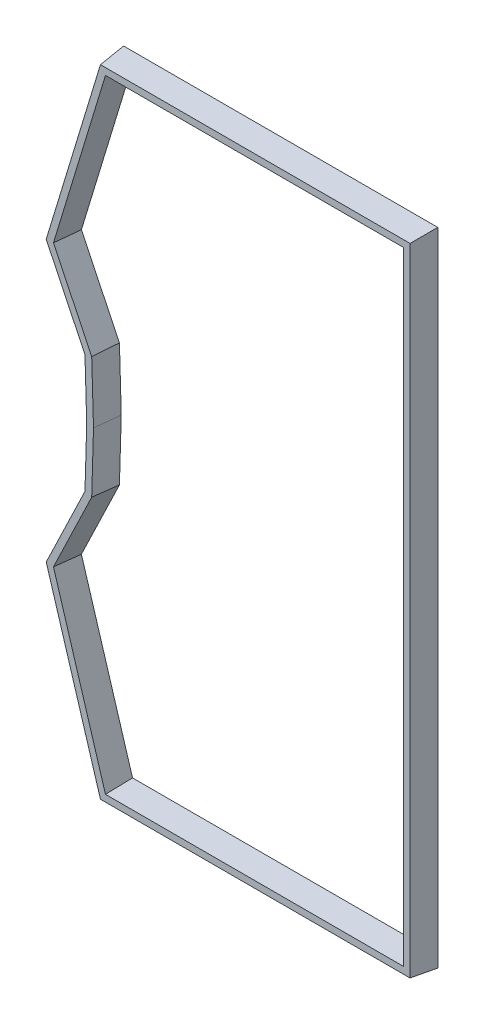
ISO-10303-21;
HEADER;
FILE_DESCRIPTION(('STEP AP214'),'2;1');
FILE_NAME('part.step','',(''),(''),'','','');
FILE_SCHEMA(('AUTOMOTIVE_DESIGN { 1 0 10303 214 1 1 1 1 }'));
ENDSEC;
DATA;
#1=APPLICATION_CONTEXT('core data for automotive mechanical design processes');
#2=APPLICATION_PROTOCOL_DEFINITION('international standard','automotive_design',2000,#1);
#3=PRODUCT_CONTEXT('',#1,'mechanical');
#4=PRODUCT('Part','Part','',(#3));
#5=PRODUCT_RELATED_PRODUCT_CATEGORY('part','',(#4));
#6=PRODUCT_DEFINITION_FORMATION('','',#4);
#7=PRODUCT_DEFINITION_CONTEXT('part definition',#1,'design');
#8=PRODUCT_DEFINITION('design','',#6,#7);
#9=PRODUCT_DEFINITION_SHAPE('','',#8);
#10=(LENGTH_UNIT() NAMED_UNIT(*) SI_UNIT(.MILLI.,.METRE.));
#11=(NAMED_UNIT(*) PLANE_ANGLE_UNIT() SI_UNIT($,.RADIAN.));
#12=(NAMED_UNIT(*) SI_UNIT($,.STERADIAN.) SOLID_ANGLE_UNIT());
#13=UNCERTAINTY_MEASURE_WITH_UNIT(LENGTH_MEASURE(1.E-05),#10,'distance_accuracy_value','');
#14=(GEOMETRIC_REPRESENTATION_CONTEXT(3) GLOBAL_UNCERTAINTY_ASSIGNED_CONTEXT((#13)) GLOBAL_UNIT_ASSIGNED_CONTEXT((#10,
#11,#12)) REPRESENTATION_CONTEXT('',''));
#15=CARTESIAN_POINT('',(0.,0.,0.));
#16=DIRECTION('',(0.,0.,1.));
#17=DIRECTION('',(1.,0.,0.));
#18=AXIS2_PLACEMENT_3D('',#15,#16,#17);
#19=CARTESIAN_POINT('',(0.,0.,2.5));
#20=DIRECTION('',(0.,0.,1.));
#21=DIRECTION('',(1.,0.,0.));
#22=AXIS2_PLACEMENT_3D('',#19,#20,#21);
#23=PLANE('',#22);
#24=DIRECTION('',(-0.433488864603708,0.901158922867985,0.));
#25=VECTOR('',#24,1.);
#26=CARTESIAN_POINT('',(9.62150357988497,48.8071060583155,2.5));
#27=LINE('',#26,#25);
#28=CARTESIAN_POINT('',(9.66591612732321,48.7147789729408,2.5));
#29=VERTEX_POINT('',#28);
#30=CARTESIAN_POINT('',(13.5234923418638,40.6954513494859,2.5));
#31=VERTEX_POINT('',#30);
#32=EDGE_CURVE('E179',#29,#31,#27,.F.);
#33=ORIENTED_EDGE('',*,*,#32,.T.);
#34=DIRECTION('',(-0.0296762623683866,0.999559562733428,0.));
#35=VECTOR('',#34,1.);
#36=CARTESIAN_POINT('',(13.5251489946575,40.6396517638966,2.5));
#37=LINE('',#36,#35);
#38=CARTESIAN_POINT('',(13.6985075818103,34.8005662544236,2.5));
#39=VERTEX_POINT('',#38);
#40=EDGE_CURVE('E199',#31,#39,#37,.F.);
#41=ORIENTED_EDGE('',*,*,#40,.T.);
#42=DIRECTION('',(0.0296762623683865,0.999559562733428,0.));
#43=VECTOR('',#42,1.);
#44=CARTESIAN_POINT('',(13.6982760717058,34.7927685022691,2.5));
#45=LINE('',#44,#43);
#46=CARTESIAN_POINT('',(13.5234923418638,28.9056811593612,2.5));
#47=VERTEX_POINT('',#46);
#48=EDGE_CURVE('E203',#39,#47,#45,.F.);
#49=ORIENTED_EDGE('',*,*,#48,.T.);
#50=DIRECTION('',(0.433488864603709,0.901158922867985,0.));
#51=VECTOR('',#50,1.);
#52=CARTESIAN_POINT('',(13.4992931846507,28.8553747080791,2.5));
#53=LINE('',#52,#51);
#54=CARTESIAN_POINT('',(9.6659161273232,20.8863535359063,2.5));
#55=VERTEX_POINT('',#54);
#56=EDGE_CURVE('E212',#47,#55,#53,.F.);
#57=ORIENTED_EDGE('',*,*,#56,.T.);
#58=DIRECTION('',(-0.290931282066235,0.9567439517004,0.));
#59=VECTOR('',#58,1.);
#60=CARTESIAN_POINT('',(9.6361091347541,20.9843755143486,2.5));
#61=LINE('',#60,#59);
#62=CARTESIAN_POINT('',(15.0644512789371,3.13296580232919,2.5));
#63=VERTEX_POINT('',#62);
#64=EDGE_CURVE('E214',#55,#63,#61,.F.);
#65=ORIENTED_EDGE('',*,*,#64,.T.);
#66=DIRECTION('',(-1.,0.,0.));
#67=VECTOR('',#66,1.);
#68=CARTESIAN_POINT('',(14.8697123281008,3.13296580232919,2.5));
#69=LINE('',#68,#67);
#70=CARTESIAN_POINT('',(45.8863174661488,3.13296580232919,2.5));
#71=VERTEX_POINT('',#70);
#72=EDGE_CURVE('E216',#63,#71,#69,.F.);
#73=ORIENTED_EDGE('',*,*,#72,.T.);
#74=DIRECTION('',(0.,-1.,0.));
#75=VECTOR('',#74,1.);
#76=CARTESIAN_POINT('',(45.8863174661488,2.870205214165,2.5));
#77=LINE('',#76,#75);
#78=CARTESIAN_POINT('',(45.8863174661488,66.4681667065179,2.5));
#79=VERTEX_POINT('',#78);
#80=EDGE_CURVE('E219',#71,#79,#77,.F.);
#81=ORIENTED_EDGE('',*,*,#80,.T.);
#82=DIRECTION('',(1.,0.,0.));
#83=VECTOR('',#82,1.);
#84=CARTESIAN_POINT('',(46.149078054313,66.4681667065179,2.5));
#85=LINE('',#84,#83);
#86=CARTESIAN_POINT('',(15.0644512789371,66.4681667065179,2.5));
#87=VERTEX_POINT('',#86);
#88=EDGE_CURVE('E182',#79,#87,#85,.F.);
#89=ORIENTED_EDGE('',*,*,#88,.T.);
#90=DIRECTION('',(0.290931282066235,0.9567439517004,0.));
#91=VECTOR('',#90,1.);
#92=CARTESIAN_POINT('',(15.1211069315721,66.654482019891,2.5));
#93=LINE('',#92,#91);
#94=EDGE_CURVE('E175',#87,#29,#93,.F.);
#95=ORIENTED_EDGE('',*,*,#94,.T.);
#96=EDGE_LOOP('',(#33,#41,#49,#57,#65,#73,#81,#89,#95));
#97=FACE_BOUND('',#96,.T.);
#98=DIRECTION('',(1.,0.,0.));
#99=VECTOR('',#98,1.);
#100=CARTESIAN_POINT('',(15.7590646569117,3.80744462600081,2.5));
#101=LINE('',#100,#99);
#102=CARTESIAN_POINT('',(15.5643257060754,3.80744462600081,2.5));
#103=VERTEX_POINT('',#102);
#104=CARTESIAN_POINT('',(45.2118386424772,3.80744462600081,2.5));
#105=VERTEX_POINT('',#104);
#106=EDGE_CURVE('E51',#103,#105,#101,.T.);
#107=ORIENTED_EDGE('',*,*,#106,.F.);
#108=DIRECTION('',(0.290931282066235,-0.9567439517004,0.));
#109=VECTOR('',#108,1.);
#110=CARTESIAN_POINT('',(10.4175380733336,20.7329464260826,2.5));
#111=LINE('',#110,#109);
#112=CARTESIAN_POINT('',(10.3877310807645,20.8309684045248,2.5));
#113=VERTEX_POINT('',#112);
#114=EDGE_CURVE('E107',#113,#103,#111,.T.);
#115=ORIENTED_EDGE('',*,*,#114,.F.);
#116=DIRECTION('',(-0.433488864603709,-0.901158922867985,0.));
#117=VECTOR('',#116,1.);
#118=CARTESIAN_POINT('',(14.2176208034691,28.7927399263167,2.5));
#119=LINE('',#118,#117);
#120=CARTESIAN_POINT('',(14.193421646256,28.7424334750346,2.5));
#121=VERTEX_POINT('',#120);
#122=EDGE_CURVE('E226',#121,#113,#119,.T.);
#123=ORIENTED_EDGE('',*,*,#122,.F.);
#124=DIRECTION('',(-0.0296762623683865,-0.999559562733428,0.));
#125=VECTOR('',#124,1.);
#126=CARTESIAN_POINT('',(14.3735151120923,34.808364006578,2.5));
#127=LINE('',#126,#125);
#128=CARTESIAN_POINT('',(14.3732836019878,34.8005662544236,2.5));
#129=VERTEX_POINT('',#128);
#130=EDGE_CURVE('E253',#129,#121,#127,.T.);
#131=ORIENTED_EDGE('',*,*,#130,.F.);
#132=DIRECTION('',(0.0296762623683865,-0.999559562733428,0.));
#133=VECTOR('',#132,1.);
#134=CARTESIAN_POINT('',(14.1917649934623,40.9144986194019,2.5));
#135=LINE('',#134,#133);
#136=CARTESIAN_POINT('',(14.193421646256,40.8586990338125,2.5));
#137=VERTEX_POINT('',#136);
#138=EDGE_CURVE('E256',#137,#129,#135,.T.);
#139=ORIENTED_EDGE('',*,*,#138,.F.);
#140=DIRECTION('',(0.433488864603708,-0.901158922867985,0.));
#141=VECTOR('',#140,1.);
#142=CARTESIAN_POINT('',(10.4321436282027,48.6778370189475,2.5));
#143=LINE('',#142,#141);
#144=CARTESIAN_POINT('',(10.3877310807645,48.7701641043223,2.5));
#145=VERTEX_POINT('',#144);
#146=EDGE_CURVE('E259',#145,#137,#143,.T.);
#147=ORIENTED_EDGE('',*,*,#146,.F.);
#148=DIRECTION('',(-0.290931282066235,-0.9567439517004,0.));
#149=VECTOR('',#148,1.);
#150=CARTESIAN_POINT('',(15.5076700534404,65.6073725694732,2.5));
#151=LINE('',#150,#149);
#152=CARTESIAN_POINT('',(15.5643257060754,65.7936878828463,2.5));
#153=VERTEX_POINT('',#152);
#154=EDGE_CURVE('E262',#153,#145,#151,.T.);
#155=ORIENTED_EDGE('',*,*,#154,.F.);
#156=DIRECTION('',(-1.,0.,0.));
#157=VECTOR('',#156,1.);
#158=CARTESIAN_POINT('',(44.949078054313,65.7936878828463,2.5));
#159=LINE('',#158,#157);
#160=CARTESIAN_POINT('',(45.2118386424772,65.7936878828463,2.5));
#161=VERTEX_POINT('',#160);
#162=EDGE_CURVE('E264',#161,#153,#159,.T.);
#163=ORIENTED_EDGE('',*,*,#162,.F.);
#164=DIRECTION('',(0.,1.,0.));
#165=VECTOR('',#164,1.);
#166=CARTESIAN_POINT('',(45.2118386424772,4.070205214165,2.5));
#167=LINE('',#166,#165);
#168=EDGE_CURVE('E265',#105,#161,#167,.T.);
#169=ORIENTED_EDGE('',*,*,#168,.F.);
#170=EDGE_LOOP('',(#107,#115,#123,#131,#139,#147,#155,#163,#169));
#171=FACE_BOUND('',#170,.T.);
#172=ADVANCED_FACE('F47',(#97,#171),#23,.T.);
#173=CARTESIAN_POINT('',(0.,0.,0.));
#174=DIRECTION('',(0.,0.,1.));
#175=DIRECTION('',(1.,0.,0.));
#176=AXIS2_PLACEMENT_3D('',#173,#174,#175);
#177=PLANE('',#176);
#178=DIRECTION('',(0.433488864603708,-0.901158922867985,0.));
#179=VECTOR('',#178,1.);
#180=CARTESIAN_POINT('',(9.38471453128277,48.6932022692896,0.));
#181=LINE('',#180,#179);
#182=CARTESIAN_POINT('',(9.38471453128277,48.6932022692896,0.));
#183=VERTEX_POINT('',#182);
#184=CARTESIAN_POINT('',(13.2625041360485,40.6318540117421,0.));
#185=VERTEX_POINT('',#184);
#186=EDGE_CURVE('E229',#183,#185,#181,.T.);
#187=ORIENTED_EDGE('',*,*,#186,.F.);
#188=DIRECTION('',(-0.290931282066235,-0.9567439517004,0.));
#189=VECTOR('',#188,1.);
#190=CARTESIAN_POINT('',(14.8697123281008,66.7309272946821,0.));
#191=LINE('',#190,#189);
#192=CARTESIAN_POINT('',(14.8697123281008,66.7309272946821,0.));
#193=VERTEX_POINT('',#192);
#194=EDGE_CURVE('E191',#193,#183,#191,.T.);
#195=ORIENTED_EDGE('',*,*,#194,.F.);
#196=DIRECTION('',(-1.,0.,0.));
#197=VECTOR('',#196,1.);
#198=CARTESIAN_POINT('',(46.149078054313,66.7309272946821,0.));
#199=LINE('',#198,#197);
#200=CARTESIAN_POINT('',(46.149078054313,66.7309272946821,0.));
#201=VERTEX_POINT('',#200);
#202=EDGE_CURVE('E205',#201,#193,#199,.T.);
#203=ORIENTED_EDGE('',*,*,#202,.F.);
#204=DIRECTION('',(0.,1.,0.));
#205=VECTOR('',#204,1.);
#206=CARTESIAN_POINT('',(46.149078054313,2.870205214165,0.));
#207=LINE('',#206,#205);
#208=CARTESIAN_POINT('',(46.149078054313,2.870205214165,0.));
#209=VERTEX_POINT('',#208);
#210=EDGE_CURVE('E272',#209,#201,#207,.T.);
#211=ORIENTED_EDGE('',*,*,#210,.F.);
#212=DIRECTION('',(1.,0.,0.));
#213=VECTOR('',#212,1.);
#214=CARTESIAN_POINT('',(14.8697123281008,2.870205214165,0.));
#215=LINE('',#214,#213);
#216=CARTESIAN_POINT('',(14.8697123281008,2.870205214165,0.));
#217=VERTEX_POINT('',#216);
#218=EDGE_CURVE('E281',#217,#209,#215,.T.);
#219=ORIENTED_EDGE('',*,*,#218,.F.);
#220=DIRECTION('',(0.290931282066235,-0.9567439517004,0.));
#221=VECTOR('',#220,1.);
#222=CARTESIAN_POINT('',(9.38471453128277,20.9079302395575,0.));
#223=LINE('',#222,#221);
#224=CARTESIAN_POINT('',(9.38471453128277,20.9079302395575,0.));
#225=VERTEX_POINT('',#224);
#226=EDGE_CURVE('E282',#225,#217,#223,.T.);
#227=ORIENTED_EDGE('',*,*,#226,.F.);
#228=DIRECTION('',(-0.433488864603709,-0.901158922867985,0.));
#229=VECTOR('',#228,1.);
#230=CARTESIAN_POINT('',(13.2625041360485,28.969278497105,0.));
#231=LINE('',#230,#229);
#232=CARTESIAN_POINT('',(13.2625041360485,28.969278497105,0.));
#233=VERTEX_POINT('',#232);
#234=EDGE_CURVE('E321',#233,#225,#231,.T.);
#235=ORIENTED_EDGE('',*,*,#234,.F.);
#236=DIRECTION('',(-0.0296762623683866,-0.999559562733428,0.));
#237=VECTOR('',#236,1.);
#238=CARTESIAN_POINT('',(13.4356312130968,34.8005662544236,0.));
#239=LINE('',#238,#237);
#240=CARTESIAN_POINT('',(13.4356312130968,34.8005662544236,0.));
#241=VERTEX_POINT('',#240);
#242=EDGE_CURVE('E314',#241,#233,#239,.T.);
#243=ORIENTED_EDGE('',*,*,#242,.F.);
#244=DIRECTION('',(0.0296762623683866,-0.999559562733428,0.));
#245=VECTOR('',#244,1.);
#246=CARTESIAN_POINT('',(13.2625041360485,40.6318540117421,0.));
#247=LINE('',#246,#245);
#248=EDGE_CURVE('E319',#185,#241,#247,.T.);
#249=ORIENTED_EDGE('',*,*,#248,.F.);
#250=EDGE_LOOP('',(#187,#195,#203,#211,#219,#227,#235,#243,#249));
#251=FACE_BOUND('',#250,.T.);
#252=DIRECTION('',(0.290931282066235,-0.9567439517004,0.));
#253=VECTOR('',#252,1.);
#254=CARTESIAN_POINT('',(10.6689326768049,20.8093917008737,0.));
#255=LINE('',#254,#253);
#256=CARTESIAN_POINT('',(10.6689326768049,20.8093917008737,0.));
#257=VERTEX_POINT('',#256);
#258=CARTESIAN_POINT('',(15.7590646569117,4.070205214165,0.));
#259=VERTEX_POINT('',#258);
#260=EDGE_CURVE('E279',#257,#259,#255,.T.);
#261=ORIENTED_EDGE('',*,*,#260,.T.);
#262=DIRECTION('',(1.,0.,0.));
#263=VECTOR('',#262,1.);
#264=CARTESIAN_POINT('',(15.7590646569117,4.070205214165,0.));
#265=LINE('',#264,#263);
#266=CARTESIAN_POINT('',(44.949078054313,4.070205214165,0.));
#267=VERTEX_POINT('',#266);
#268=EDGE_CURVE('E275',#259,#267,#265,.T.);
#269=ORIENTED_EDGE('',*,*,#268,.T.);
#270=DIRECTION('',(0.,1.,0.));
#271=VECTOR('',#270,1.);
#272=CARTESIAN_POINT('',(44.949078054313,4.070205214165,0.));
#273=LINE('',#272,#271);
#274=CARTESIAN_POINT('',(44.949078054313,65.5309272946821,0.));
#275=VERTEX_POINT('',#274);
#276=EDGE_CURVE('E278',#267,#275,#273,.T.);
#277=ORIENTED_EDGE('',*,*,#276,.T.);
#278=DIRECTION('',(-1.,0.,0.));
#279=VECTOR('',#278,1.);
#280=CARTESIAN_POINT('',(44.949078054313,65.5309272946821,0.));
#281=LINE('',#280,#279);
#282=CARTESIAN_POINT('',(15.7590646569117,65.5309272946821,0.));
#283=VERTEX_POINT('',#282);
#284=EDGE_CURVE('E346',#275,#283,#281,.T.);
#285=ORIENTED_EDGE('',*,*,#284,.T.);
#286=DIRECTION('',(-0.290931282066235,-0.9567439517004,0.));
#287=VECTOR('',#286,1.);
#288=CARTESIAN_POINT('',(15.7590646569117,65.5309272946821,0.));
#289=LINE('',#288,#287);
#290=CARTESIAN_POINT('',(10.6689326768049,48.7917408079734,0.));
#291=VERTEX_POINT('',#290);
#292=EDGE_CURVE('E343',#283,#291,#289,.T.);
#293=ORIENTED_EDGE('',*,*,#292,.T.);
#294=DIRECTION('',(0.433488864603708,-0.901158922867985,0.));
#295=VECTOR('',#294,1.);
#296=CARTESIAN_POINT('',(10.6689326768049,48.7917408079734,0.));
#297=LINE('',#296,#295);
#298=CARTESIAN_POINT('',(14.4544098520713,40.9222963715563,0.));
#299=VERTEX_POINT('',#298);
#300=EDGE_CURVE('E340',#291,#299,#297,.T.);
#301=ORIENTED_EDGE('',*,*,#300,.T.);
#302=DIRECTION('',(0.0296762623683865,-0.999559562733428,0.));
#303=VECTOR('',#302,1.);
#304=CARTESIAN_POINT('',(14.4544098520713,40.9222963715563,0.));
#305=LINE('',#304,#303);
#306=CARTESIAN_POINT('',(14.6361599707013,34.8005662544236,0.));
#307=VERTEX_POINT('',#306);
#308=EDGE_CURVE('E337',#299,#307,#305,.T.);
#309=ORIENTED_EDGE('',*,*,#308,.T.);
#310=DIRECTION('',(-0.0296762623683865,-0.999559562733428,0.));
#311=VECTOR('',#310,1.);
#312=CARTESIAN_POINT('',(14.6361599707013,34.8005662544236,0.));
#313=LINE('',#312,#311);
#314=CARTESIAN_POINT('',(14.4544098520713,28.6788361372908,0.));
#315=VERTEX_POINT('',#314);
#316=EDGE_CURVE('E334',#307,#315,#313,.T.);
#317=ORIENTED_EDGE('',*,*,#316,.T.);
#318=DIRECTION('',(-0.433488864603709,-0.901158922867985,0.));
#319=VECTOR('',#318,1.);
#320=CARTESIAN_POINT('',(14.4544098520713,28.6788361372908,0.));
#321=LINE('',#320,#319);
#322=EDGE_CURVE('E251',#315,#257,#321,.T.);
#323=ORIENTED_EDGE('',*,*,#322,.T.);
#324=EDGE_LOOP('',(#261,#269,#277,#285,#293,#301,#309,#317,#323));
#325=FACE_BOUND('',#324,.T.);
#326=ADVANCED_FACE('F317',(#251,#325),#177,.F.);
#327=CARTESIAN_POINT('',(9.38471453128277,48.6932022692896,0.));
#328=DIRECTION('',(-0.896222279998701,-0.431114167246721,0.104528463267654));
#329=DIRECTION('',(0.433488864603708,-0.901158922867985,0.));
#330=AXIS2_PLACEMENT_3D('',#327,#328,#329);
#331=PLANE('',#330);
#332=ORIENTED_EDGE('',*,*,#186,.T.);
#333=DIRECTION('',(-0.103797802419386,-0.0252933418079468,-0.9942767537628));
#334=VECTOR('',#333,1.);
#335=CARTESIAN_POINT('',(13.2418891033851,40.6268305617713,-0.197470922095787));
#336=LINE('',#335,#334);
#337=EDGE_CURVE('E11',#31,#185,#336,.T.);
#338=ORIENTED_EDGE('',*,*,#337,.F.);
#339=ORIENTED_EDGE('',*,*,#32,.F.);
#340=DIRECTION('',(-0.111771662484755,-0.00857628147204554,-0.99369690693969));
#341=VECTOR('',#340,1.);
#342=CARTESIAN_POINT('',(9.38471453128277,48.6932022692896,0.));
#343=LINE('',#342,#341);
#344=EDGE_CURVE('E186',#29,#183,#343,.T.);
#345=ORIENTED_EDGE('',*,*,#344,.T.);
#346=EDGE_LOOP('',(#332,#338,#339,#345));
#347=FACE_BOUND('',#346,.T.);
#348=ADVANCED_FACE('F197',(#347),#331,.T.);
#349=CARTESIAN_POINT('',(13.2625041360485,40.6318540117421,0.));
#350=DIRECTION('',(-0.994083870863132,-0.029513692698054,0.104528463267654));
#351=DIRECTION('',(0.104574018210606,0.,0.994517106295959));
#352=AXIS2_PLACEMENT_3D('',#349,#350,#351);
#353=PLANE('',#352);
#354=ORIENTED_EDGE('',*,*,#248,.T.);
#355=DIRECTION('',(-0.104574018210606,0.,-0.994517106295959));
#356=VECTOR('',#355,1.);
#357=CARTESIAN_POINT('',(13.4337379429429,34.8005662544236,-0.0180053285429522));
#358=LINE('',#357,#356);
#359=EDGE_CURVE('E58',#39,#241,#358,.T.);
#360=ORIENTED_EDGE('',*,*,#359,.F.);
#361=ORIENTED_EDGE('',*,*,#40,.F.);
#362=ORIENTED_EDGE('',*,*,#337,.T.);
#363=EDGE_LOOP('',(#354,#360,#361,#362));
#364=FACE_BOUND('',#363,.T.);
#365=ADVANCED_FACE('F404',(#364),#353,.T.);
#366=CARTESIAN_POINT('',(13.4356312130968,34.8005662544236,0.));
#367=DIRECTION('',(-0.994083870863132,0.029513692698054,0.104528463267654));
#368=DIRECTION('',(0.104574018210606,0.,0.994517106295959));
#369=AXIS2_PLACEMENT_3D('',#366,#367,#368);
#370=PLANE('',#369);
#371=ORIENTED_EDGE('',*,*,#242,.T.);
#372=DIRECTION('',(-0.103797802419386,0.0252933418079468,-0.9942767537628));
#373=VECTOR('',#372,1.);
#374=CARTESIAN_POINT('',(13.2490599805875,28.9725545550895,-0.128781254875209));
#375=LINE('',#374,#373);
#376=EDGE_CURVE('E301',#47,#233,#375,.T.);
#377=ORIENTED_EDGE('',*,*,#376,.F.);
#378=ORIENTED_EDGE('',*,*,#48,.F.);
#379=ORIENTED_EDGE('',*,*,#359,.T.);
#380=EDGE_LOOP('',(#371,#377,#378,#379));
#381=FACE_BOUND('',#380,.T.);
#382=ADVANCED_FACE('F313',(#381),#370,.T.);
#383=CARTESIAN_POINT('',(13.2625041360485,28.969278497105,0.));
#384=DIRECTION('',(-0.8962222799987,0.431114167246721,0.104528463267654));
#385=DIRECTION('',(-0.433488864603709,-0.901158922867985,0.));
#386=AXIS2_PLACEMENT_3D('',#383,#384,#385);
#387=PLANE('',#386);
#388=ORIENTED_EDGE('',*,*,#234,.T.);
#389=DIRECTION('',(-0.111771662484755,0.0085762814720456,-0.99369690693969));
#390=VECTOR('',#389,1.);
#391=CARTESIAN_POINT('',(9.38471453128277,20.9079302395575,0.));
#392=LINE('',#391,#390);
#393=EDGE_CURVE('E294',#55,#225,#392,.T.);
#394=ORIENTED_EDGE('',*,*,#393,.F.);
#395=ORIENTED_EDGE('',*,*,#56,.F.);
#396=ORIENTED_EDGE('',*,*,#376,.T.);
#397=EDGE_LOOP('',(#388,#394,#395,#396));
#398=FACE_BOUND('',#397,.T.);
#399=ADVANCED_FACE('F420',(#398),#387,.T.);
#400=CARTESIAN_POINT('',(9.38471453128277,20.9079302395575,0.));
#401=DIRECTION('',(-0.951502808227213,-0.289337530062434,0.104528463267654));
#402=DIRECTION('',(0.290931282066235,-0.9567439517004,0.));
#403=AXIS2_PLACEMENT_3D('',#400,#401,#402);
#404=PLANE('',#403);
#405=ORIENTED_EDGE('',*,*,#226,.T.);
#406=DIRECTION('',(-0.0772374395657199,-0.104216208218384,-0.991550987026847));
#407=VECTOR('',#406,1.);
#408=CARTESIAN_POINT('',(14.8697123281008,2.870205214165,0.));
#409=LINE('',#408,#407);
#410=EDGE_CURVE('E286',#63,#217,#409,.T.);
#411=ORIENTED_EDGE('',*,*,#410,.F.);
#412=ORIENTED_EDGE('',*,*,#64,.F.);
#413=ORIENTED_EDGE('',*,*,#393,.T.);
#414=EDGE_LOOP('',(#405,#411,#412,#413));
#415=FACE_BOUND('',#414,.T.);
#416=ADVANCED_FACE('F416',(#415),#404,.T.);
#417=CARTESIAN_POINT('',(14.8697123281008,2.870205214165,0.));
#418=DIRECTION('',(0.,-0.994521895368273,0.104528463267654));
#419=DIRECTION('',(0.,-0.104528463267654,-0.994521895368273));
#420=AXIS2_PLACEMENT_3D('',#417,#418,#419);
#421=PLANE('',#420);
#422=ORIENTED_EDGE('',*,*,#218,.T.);
#423=DIRECTION('',(0.103962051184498,-0.103962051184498,-0.989132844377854));
#424=VECTOR('',#423,1.);
#425=CARTESIAN_POINT('',(46.149078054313,2.870205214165,0.));
#426=LINE('',#425,#424);
#427=EDGE_CURVE('E284',#71,#209,#426,.T.);
#428=ORIENTED_EDGE('',*,*,#427,.F.);
#429=ORIENTED_EDGE('',*,*,#72,.F.);
#430=ORIENTED_EDGE('',*,*,#410,.T.);
#431=EDGE_LOOP('',(#422,#428,#429,#430));
#432=FACE_BOUND('',#431,.T.);
#433=ADVANCED_FACE('F413',(#432),#421,.T.);
#434=CARTESIAN_POINT('',(46.149078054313,2.870205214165,0.));
#435=DIRECTION('',(0.994521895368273,0.,0.104528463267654));
#436=DIRECTION('',(0.104528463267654,0.,-0.994521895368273));
#437=AXIS2_PLACEMENT_3D('',#434,#435,#436);
#438=PLANE('',#437);
#439=ORIENTED_EDGE('',*,*,#210,.T.);
#440=DIRECTION('',(0.103962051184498,0.103962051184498,-0.989132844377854));
#441=VECTOR('',#440,1.);
#442=CARTESIAN_POINT('',(46.149078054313,66.7309272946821,0.));
#443=LINE('',#442,#441);
#444=EDGE_CURVE('E287',#79,#201,#443,.T.);
#445=ORIENTED_EDGE('',*,*,#444,.F.);
#446=ORIENTED_EDGE('',*,*,#80,.F.);
#447=ORIENTED_EDGE('',*,*,#427,.T.);
#448=EDGE_LOOP('',(#439,#445,#446,#447));
#449=FACE_BOUND('',#448,.T.);
#450=ADVANCED_FACE('F410',(#449),#438,.T.);
#451=CARTESIAN_POINT('',(46.149078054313,66.7309272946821,0.));
#452=DIRECTION('',(0.,0.994521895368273,0.104528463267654));
#453=DIRECTION('',(0.,-0.104528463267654,0.994521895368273));
#454=AXIS2_PLACEMENT_3D('',#451,#452,#453);
#455=PLANE('',#454);
#456=ORIENTED_EDGE('',*,*,#202,.T.);
#457=DIRECTION('',(-0.0772374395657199,0.104216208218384,-0.991550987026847));
#458=VECTOR('',#457,1.);
#459=CARTESIAN_POINT('',(14.8697123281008,66.7309272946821,0.));
#460=LINE('',#459,#458);
#461=EDGE_CURVE('E195',#87,#193,#460,.T.);
#462=ORIENTED_EDGE('',*,*,#461,.F.);
#463=ORIENTED_EDGE('',*,*,#88,.F.);
#464=ORIENTED_EDGE('',*,*,#444,.T.);
#465=EDGE_LOOP('',(#456,#462,#463,#464));
#466=FACE_BOUND('',#465,.T.);
#467=ADVANCED_FACE('F407',(#466),#455,.T.);
#468=CARTESIAN_POINT('',(14.8697123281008,66.7309272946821,0.));
#469=DIRECTION('',(-0.951502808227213,0.289337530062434,0.104528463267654));
#470=DIRECTION('',(-0.290931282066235,-0.9567439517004,0.));
#471=AXIS2_PLACEMENT_3D('',#468,#469,#470);
#472=PLANE('',#471);
#473=ORIENTED_EDGE('',*,*,#194,.T.);
#474=ORIENTED_EDGE('',*,*,#344,.F.);
#475=ORIENTED_EDGE('',*,*,#94,.F.);
#476=ORIENTED_EDGE('',*,*,#461,.T.);
#477=EDGE_LOOP('',(#473,#474,#475,#476));
#478=FACE_BOUND('',#477,.T.);
#479=ADVANCED_FACE('F189',(#478),#472,.T.);
#480=CARTESIAN_POINT('',(10.6689326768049,20.8093917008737,0.));
#481=DIRECTION('',(0.951502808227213,0.289337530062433,0.104528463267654));
#482=DIRECTION('',(-0.290931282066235,0.9567439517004,0.));
#483=AXIS2_PLACEMENT_3D('',#480,#481,#482);
#484=PLANE('',#483);
#485=ORIENTED_EDGE('',*,*,#260,.F.);
#486=DIRECTION('',(0.111771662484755,-0.00857628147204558,-0.99369690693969));
#487=VECTOR('',#486,1.);
#488=CARTESIAN_POINT('',(10.6689326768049,20.8093917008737,0.));
#489=LINE('',#488,#487);
#490=EDGE_CURVE('E223',#113,#257,#489,.T.);
#491=ORIENTED_EDGE('',*,*,#490,.F.);
#492=ORIENTED_EDGE('',*,*,#114,.T.);
#493=DIRECTION('',(0.0772374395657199,0.104216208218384,-0.991550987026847));
#494=VECTOR('',#493,1.);
#495=CARTESIAN_POINT('',(15.7590646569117,4.070205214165,0.));
#496=LINE('',#495,#494);
#497=EDGE_CURVE('E227',#103,#259,#496,.T.);
#498=ORIENTED_EDGE('',*,*,#497,.T.);
#499=EDGE_LOOP('',(#485,#491,#492,#498));
#500=FACE_BOUND('',#499,.T.);
#501=ADVANCED_FACE('F356',(#500),#484,.T.);
#502=CARTESIAN_POINT('',(15.7590646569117,4.070205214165,0.));
#503=DIRECTION('',(0.,0.994521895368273,0.104528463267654));
#504=DIRECTION('',(0.,-0.104528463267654,0.994521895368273));
#505=AXIS2_PLACEMENT_3D('',#502,#503,#504);
#506=PLANE('',#505);
#507=ORIENTED_EDGE('',*,*,#268,.F.);
#508=ORIENTED_EDGE('',*,*,#497,.F.);
#509=ORIENTED_EDGE('',*,*,#106,.T.);
#510=DIRECTION('',(-0.103962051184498,0.103962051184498,-0.989132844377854));
#511=VECTOR('',#510,1.);
#512=CARTESIAN_POINT('',(44.949078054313,4.070205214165,0.));
#513=LINE('',#512,#511);
#514=EDGE_CURVE('E230',#105,#267,#513,.T.);
#515=ORIENTED_EDGE('',*,*,#514,.T.);
#516=EDGE_LOOP('',(#507,#508,#509,#515));
#517=FACE_BOUND('',#516,.T.);
#518=ADVANCED_FACE('F430',(#517),#506,.T.);
#519=CARTESIAN_POINT('',(44.949078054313,4.070205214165,0.));
#520=DIRECTION('',(-0.994521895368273,0.,0.104528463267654));
#521=DIRECTION('',(0.104528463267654,0.,0.994521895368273));
#522=AXIS2_PLACEMENT_3D('',#519,#520,#521);
#523=PLANE('',#522);
#524=ORIENTED_EDGE('',*,*,#276,.F.);
#525=ORIENTED_EDGE('',*,*,#514,.F.);
#526=ORIENTED_EDGE('',*,*,#168,.T.);
#527=DIRECTION('',(-0.103962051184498,-0.103962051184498,-0.989132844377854));
#528=VECTOR('',#527,1.);
#529=CARTESIAN_POINT('',(44.949078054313,65.5309272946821,0.));
#530=LINE('',#529,#528);
#531=EDGE_CURVE('E233',#161,#275,#530,.T.);
#532=ORIENTED_EDGE('',*,*,#531,.T.);
#533=EDGE_LOOP('',(#524,#525,#526,#532));
#534=FACE_BOUND('',#533,.T.);
#535=ADVANCED_FACE('F433',(#534),#523,.T.);
#536=CARTESIAN_POINT('',(44.949078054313,65.5309272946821,0.));
#537=DIRECTION('',(0.,-0.994521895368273,0.104528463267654));
#538=DIRECTION('',(0.,-0.104528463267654,-0.994521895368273));
#539=AXIS2_PLACEMENT_3D('',#536,#537,#538);
#540=PLANE('',#539);
#541=ORIENTED_EDGE('',*,*,#284,.F.);
#542=ORIENTED_EDGE('',*,*,#531,.F.);
#543=ORIENTED_EDGE('',*,*,#162,.T.);
#544=DIRECTION('',(0.0772374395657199,-0.104216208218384,-0.991550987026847));
#545=VECTOR('',#544,1.);
#546=CARTESIAN_POINT('',(15.7590646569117,65.5309272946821,0.));
#547=LINE('',#546,#545);
#548=EDGE_CURVE('E236',#153,#283,#547,.T.);
#549=ORIENTED_EDGE('',*,*,#548,.T.);
#550=EDGE_LOOP('',(#541,#542,#543,#549));
#551=FACE_BOUND('',#550,.T.);
#552=ADVANCED_FACE('F366',(#551),#540,.T.);
#553=CARTESIAN_POINT('',(15.7590646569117,65.5309272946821,0.));
#554=DIRECTION('',(0.951502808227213,-0.289337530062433,0.104528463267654));
#555=DIRECTION('',(0.290931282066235,0.9567439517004,0.));
#556=AXIS2_PLACEMENT_3D('',#553,#554,#555);
#557=PLANE('',#556);
#558=ORIENTED_EDGE('',*,*,#292,.F.);
#559=ORIENTED_EDGE('',*,*,#548,.F.);
#560=ORIENTED_EDGE('',*,*,#154,.T.);
#561=DIRECTION('',(0.111771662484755,0.00857628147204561,-0.99369690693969));
#562=VECTOR('',#561,1.);
#563=CARTESIAN_POINT('',(10.6689326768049,48.7917408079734,0.));
#564=LINE('',#563,#562);
#565=EDGE_CURVE('E239',#145,#291,#564,.T.);
#566=ORIENTED_EDGE('',*,*,#565,.T.);
#567=EDGE_LOOP('',(#558,#559,#560,#566));
#568=FACE_BOUND('',#567,.T.);
#569=ADVANCED_FACE('F370',(#568),#557,.T.);
#570=CARTESIAN_POINT('',(10.6689326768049,48.7917408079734,0.));
#571=DIRECTION('',(0.8962222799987,0.431114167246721,0.104528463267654));
#572=DIRECTION('',(-0.433488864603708,0.901158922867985,0.));
#573=AXIS2_PLACEMENT_3D('',#570,#571,#572);
#574=PLANE('',#573);
#575=ORIENTED_EDGE('',*,*,#300,.F.);
#576=ORIENTED_EDGE('',*,*,#565,.F.);
#577=ORIENTED_EDGE('',*,*,#146,.T.);
#578=DIRECTION('',(0.103797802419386,0.0252933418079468,-0.9942767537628));
#579=VECTOR('',#578,1.);
#580=CARTESIAN_POINT('',(14.4342855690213,40.9173925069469,0.192770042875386));
#581=LINE('',#580,#579);
#582=EDGE_CURVE('E242',#137,#299,#581,.T.);
#583=ORIENTED_EDGE('',*,*,#582,.T.);
#584=EDGE_LOOP('',(#575,#576,#577,#583));
#585=FACE_BOUND('',#584,.T.);
#586=ADVANCED_FACE('F383',(#585),#574,.T.);
#587=CARTESIAN_POINT('',(14.4544098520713,40.9222963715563,0.));
#588=DIRECTION('',(0.994083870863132,0.0295136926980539,0.104528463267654));
#589=DIRECTION('',(0.104574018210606,0.,-0.994517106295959));
#590=AXIS2_PLACEMENT_3D('',#587,#588,#589);
#591=PLANE('',#590);
#592=ORIENTED_EDGE('',*,*,#308,.F.);
#593=ORIENTED_EDGE('',*,*,#582,.F.);
#594=ORIENTED_EDGE('',*,*,#138,.T.);
#595=DIRECTION('',(0.104574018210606,0.,-0.994517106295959));
#596=VECTOR('',#595,1.);
#597=CARTESIAN_POINT('',(14.6341724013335,34.8005662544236,0.0189021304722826));
#598=LINE('',#597,#596);
#599=EDGE_CURVE('E246',#129,#307,#598,.T.);
#600=ORIENTED_EDGE('',*,*,#599,.T.);
#601=EDGE_LOOP('',(#592,#593,#594,#600));
#602=FACE_BOUND('',#601,.T.);
#603=ADVANCED_FACE('F385',(#602),#591,.T.);
#604=CARTESIAN_POINT('',(14.6361599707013,34.8005662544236,0.));
#605=DIRECTION('',(0.994083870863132,-0.0295136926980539,0.104528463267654));
#606=DIRECTION('',(0.104574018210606,0.,-0.994517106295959));
#607=AXIS2_PLACEMENT_3D('',#604,#605,#606);
#608=PLANE('',#607);
#609=ORIENTED_EDGE('',*,*,#316,.F.);
#610=ORIENTED_EDGE('',*,*,#599,.F.);
#611=ORIENTED_EDGE('',*,*,#130,.T.);
#612=DIRECTION('',(0.103797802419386,-0.0252933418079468,-0.9942767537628));
#613=VECTOR('',#612,1.);
#614=CARTESIAN_POINT('',(14.4402960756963,28.6822753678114,0.135195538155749));
#615=LINE('',#614,#613);
#616=EDGE_CURVE('E67',#121,#315,#615,.T.);
#617=ORIENTED_EDGE('',*,*,#616,.T.);
#618=EDGE_LOOP('',(#609,#610,#611,#617));
#619=FACE_BOUND('',#618,.T.);
#620=ADVANCED_FACE('F387',(#619),#608,.T.);
#621=CARTESIAN_POINT('',(14.4544098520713,28.6788361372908,0.));
#622=DIRECTION('',(0.8962222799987,-0.431114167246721,0.104528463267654));
#623=DIRECTION('',(0.433488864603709,0.901158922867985,0.));
#624=AXIS2_PLACEMENT_3D('',#621,#622,#623);
#625=PLANE('',#624);
#626=ORIENTED_EDGE('',*,*,#322,.F.);
#627=ORIENTED_EDGE('',*,*,#616,.F.);
#628=ORIENTED_EDGE('',*,*,#122,.T.);
#629=ORIENTED_EDGE('',*,*,#490,.T.);
#630=EDGE_LOOP('',(#626,#627,#628,#629));
#631=FACE_BOUND('',#630,.T.);
#632=ADVANCED_FACE('F49',(#631),#625,.T.);
#633=CLOSED_SHELL('',(#172,#326,#348,#365,#382,#399,#416,#433,#450,#467,#479,#501,#518,#535,
#552,#569,#586,#603,#620,#632));
#634=MANIFOLD_SOLID_BREP('B2',#633);
#635=ADVANCED_BREP_SHAPE_REPRESENTATION('',(#18,#634),#14);
#636=SHAPE_DEFINITION_REPRESENTATION(#9,#635);
ENDSEC;
END-ISO-10303-21;
